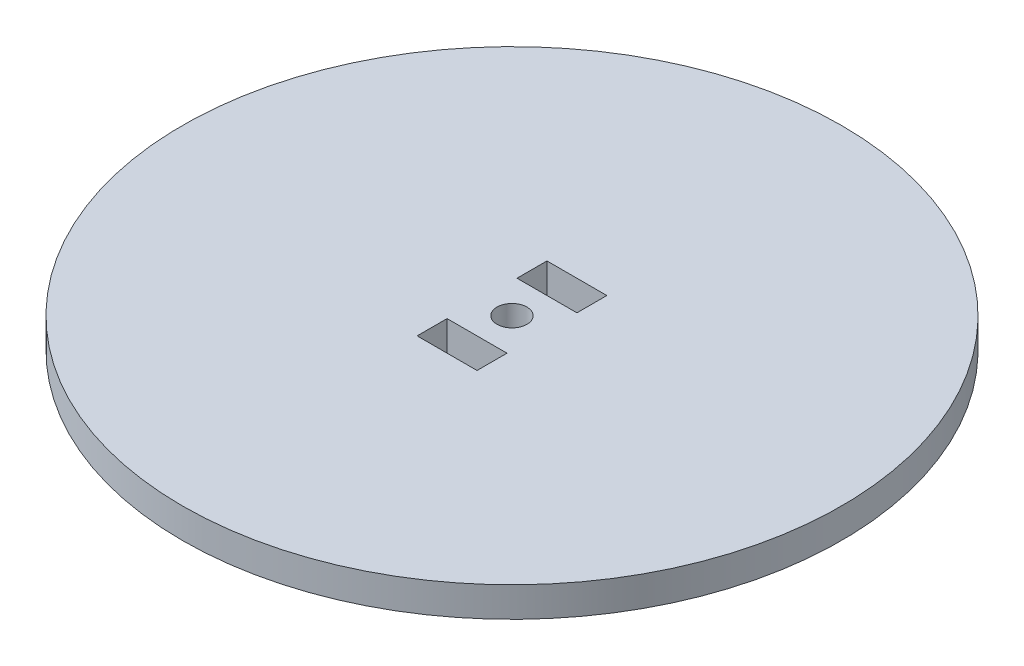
from build123d import *

# Parameters (mm, degrees)
SKETCH_1_R          = 33
SKETCH_1_R_2        = 1.5
EXTRUDE_1_DEPTH     = 3
SKETCH_2_W          = 6
SKETCH_2_H          = 3
CUT_EXTRUDE_1_DEPTH = 5


with BuildPart() as part:
    # Sketch 1 → Extrude 1 (new body)
    with BuildSketch(Plane(origin=(0, 0, 0), x_dir=(1, 0, 0), z_dir=(0, 1, 0))):
        with Locations(Location((0, 0, 0), (0, 0, 270))):
            Circle(SKETCH_1_R)
        with Locations(Location((0, 0, 0), (0, 0, 270))):
            Circle(SKETCH_1_R_2, mode=Mode.SUBTRACT)
    extrude(amount=EXTRUDE_1_DEPTH)

    # Sketch 2 → Cut-Extrude 1 (cut)
    with BuildSketch(Plane(origin=(0, 3, 0), x_dir=(1, 0, 0), z_dir=(0, 1, 0))):
        with Locations((0, -5)):
            Rectangle(SKETCH_2_W, SKETCH_2_H)
        with Locations((0, 5)):
            Rectangle(SKETCH_2_W, SKETCH_2_H)
    extrude(amount=-CUT_EXTRUDE_1_DEPTH, mode=Mode.SUBTRACT)


solid = part.part
